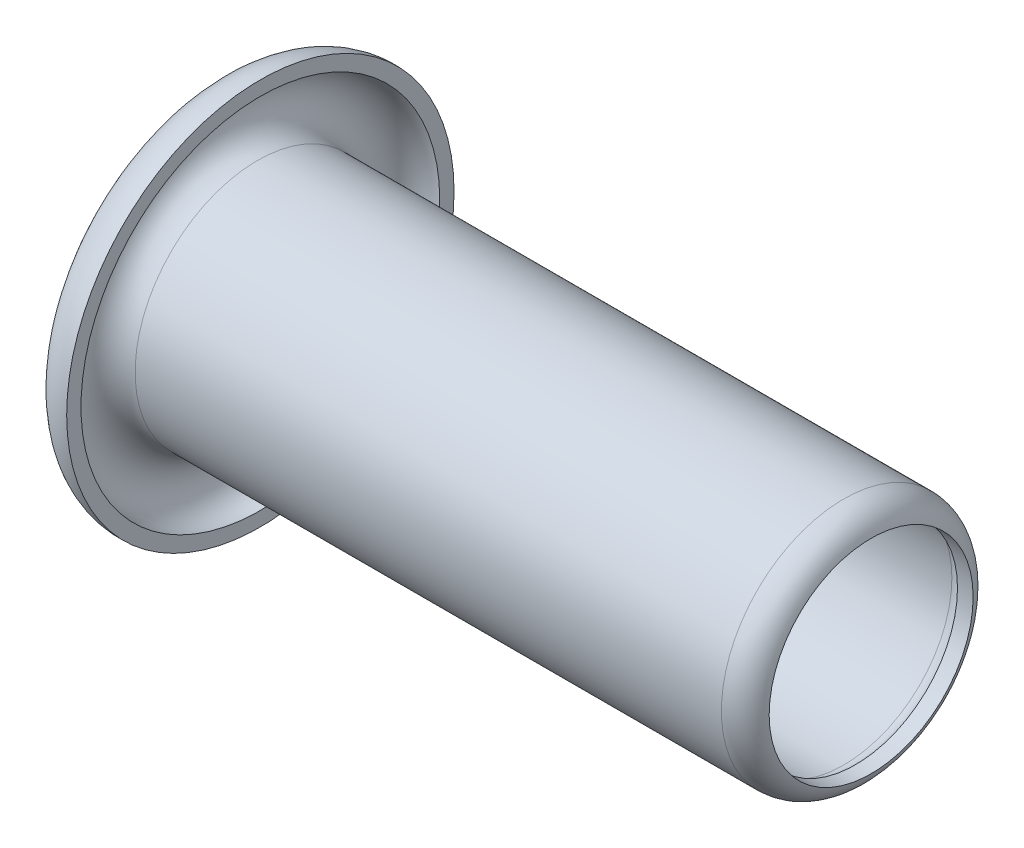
from build123d import *

# Parameters (mm, degrees)
SKETCH2_W = 1.7
SKETCH2_H = 2.5


with BuildPart() as part:
    # Sketch1 → Base-Revolve (revolve)
    with BuildSketch(Plane(origin=(2.098205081, 0.901794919, 0), x_dir=(0, 1, 0), z_dir=(0, 0, 1)), mode=Mode.PRIVATE) as base_revolve_sk:
        with BuildLine():
            Line((3.494696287, 0.978205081), (3.845869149, 0.978205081))
            ThreePointArc((3.845869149, 0.978205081), (2.833224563, 2.097620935), (1.748205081, 1.048205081))
            Line((1.748205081, 1.048205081), (1.748205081, -13.321794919))
            ThreePointArc((1.748205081, -13.321794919), (1.645692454, -13.569282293), (1.398205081, -13.671794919))
            Line((1.398205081, -13.671794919), (-0.901794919, -13.671794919))
            Line((-0.901794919, -13.671794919), (-0.901794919, -14.021794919))
            Line((-0.901794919, -14.021794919), (1.398205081, -14.021794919))
            ThreePointArc((1.398205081, -14.021794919), (1.893179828, -13.816769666), (2.098205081, -13.321794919))
            Line((2.098205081, -13.321794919), (2.098205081, 1.048205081))
            ThreePointArc((2.098205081, 1.048205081), (2.833249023, 1.747327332), (3.494696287, 0.978205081))
        make_face()
    revolve(base_revolve_sk.sketch.rotate(Axis((16.12, 0, 0), (-1, 0, 0)), 90), axis=Axis((16.12, 0, 0), (-1, 0, 0)))

    # Sketch2 → Cut-Revolve1 (revolve, cut)
    with BuildSketch(Plane.XY, mode=Mode.PRIVATE) as cut_revolve1_sk:
        with Locations((15.77, 1.25)):
            Rectangle(SKETCH2_W, SKETCH2_H)
    revolve(cut_revolve1_sk.sketch.rotate(Axis((0, 0, 0), (1, 0, 0)), 270), axis=Axis((0, 0, 0), (1, 0, 0)), mode=Mode.SUBTRACT)


solid = part.part
